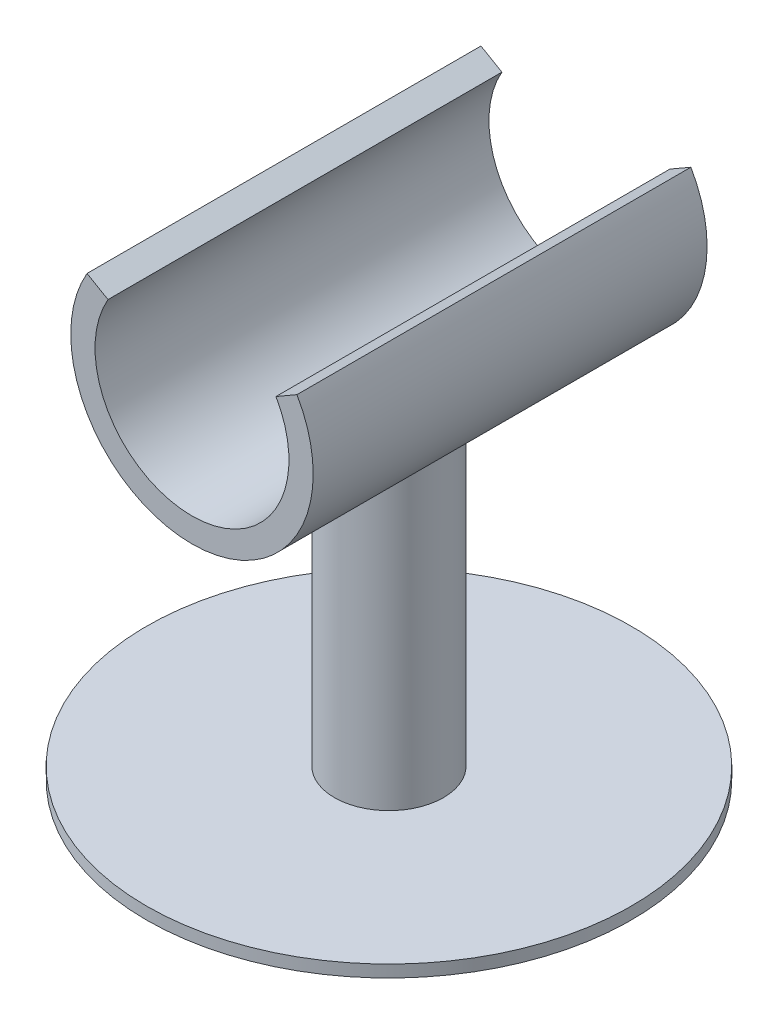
from build123d import *
from build123d.topology import SkipClean

# Parameters (mm, degrees)
ESQUISSE2_R             = 40
BOSS_EXTRU_2_DEPTH      = 2
BOSS_EXTRU_5_DEPTH      = 32.5
BOSS_EXTRU_6_REACH      = 98.354
BOSS_EXTRU_6_END_RADIUS = 20
ESQUISSE3_R             = 9


with BuildPart() as part:
    # Esquisse2 → Boss.-Extru.2 (new body)
    with BuildSketch(Plane(origin=(0, -70, 0), x_dir=(-1, 0, 0), z_dir=(0, 1, 0))):
        with Locations(Location((0, 0, 0), (0, 0, 90))):
            Circle(ESQUISSE2_R)
    extrude(amount=BOSS_EXTRU_2_DEPTH)



with BuildPart() as body_2:
    # Esquisse1 → Boss.-Extru.5 (new, symmetric)
    with BuildSketch(Plane.XY):
        with BuildLine():
            Line((0, -16), (0, -20))
            ThreePointArc((0, -20), (17.320508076, -10), (17.320508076, 10))
            Line((17.320508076, 10), (13.856406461, 8))
            ThreePointArc((13.856406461, 8), (13.856406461, -8), (0, -16))
        make_face()
    boss_extru_5 = extrude(amount=BOSS_EXTRU_5_DEPTH, both=True)

    # Sym_trie3: Boss.-Extru.5 across plane
    with SkipClean():  # the faces are left unmerged after this step: merging them gives an invalid solid
        add(boss_extru_5.mirror(Plane(origin=(0, 0, 0), x_dir=(0, 0, 1), z_dir=(1, 0, 0))))


with BuildPart() as part_1:
    with SkipClean():  # the faces are left unmerged after this step: merging them gives an invalid solid
        add(part.part)

        add(body_2.part)  # Boss.-Extru.6 merges body 2
        # Boss.-Extru.6: up to this cylinder (the profile starts outside it)
        boss_extru_6_end = Plane(origin=(0, 0, 0), z_dir=(0, 0, -1)) * Cylinder(BOSS_EXTRU_6_END_RADIUS, 237.708, mode=Mode.PRIVATE)
        # Esquisse3 → Boss.-Extru.6 (add, up to the surface)
        with BuildSketch(Plane(origin=(0, -68, 0), x_dir=(1, 0, 0), z_dir=(0, 1, 0)), mode=Mode.PRIVATE) as boss_extru_6_sk1:
            with Locations(Location((0, 0, 0), (0, 0, 90))):
                Circle(ESQUISSE3_R)
        boss_extru_6_tool1 = extrude(boss_extru_6_sk1.sketch, amount=BOSS_EXTRU_6_REACH, mode=Mode.PRIVATE) - boss_extru_6_end
        add(boss_extru_6_tool1.solids().sort_by_distance((0, -68, 0))[0])


solid = part_1.part
